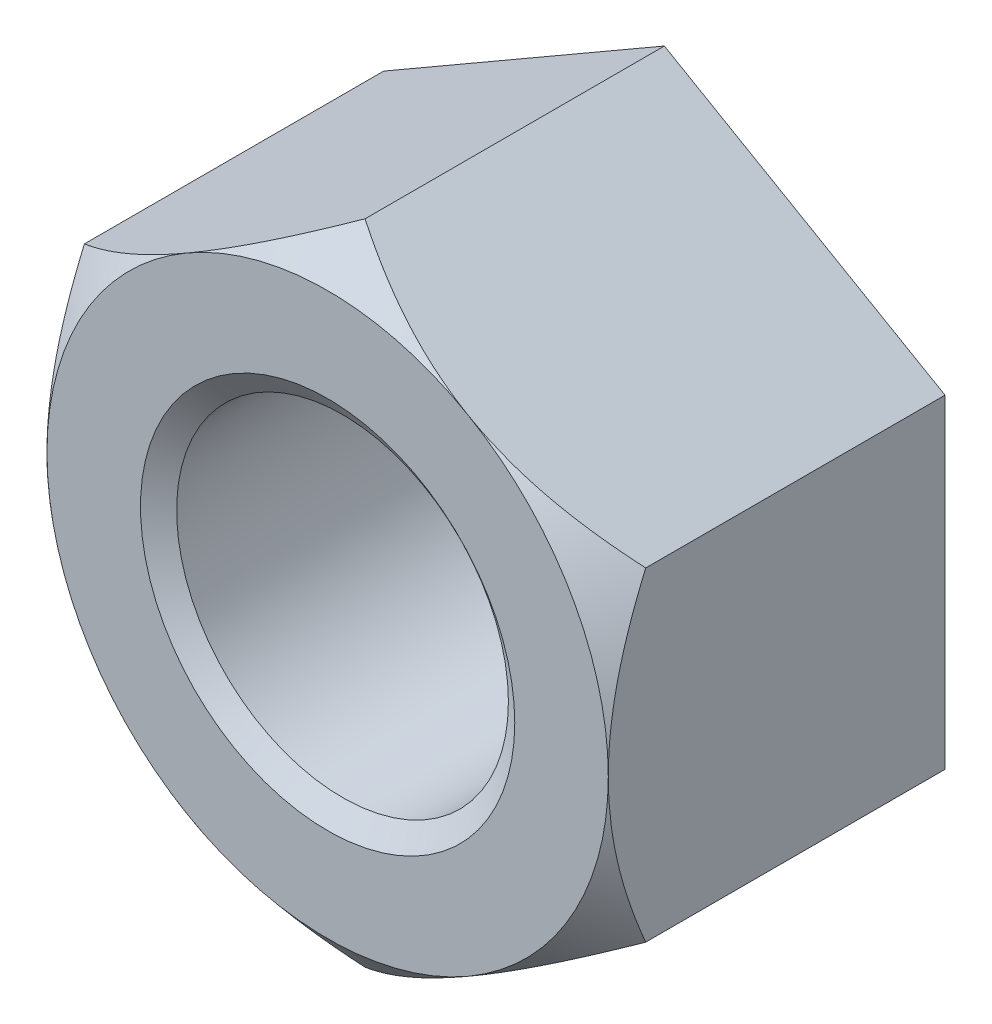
ISO-10303-21;
HEADER;
FILE_DESCRIPTION(('STEP AP214'),'2;1');
FILE_NAME('part.step','',(''),(''),'','','');
FILE_SCHEMA(('AUTOMOTIVE_DESIGN { 1 0 10303 214 1 1 1 1 }'));
ENDSEC;
DATA;
#1=APPLICATION_CONTEXT('core data for automotive mechanical design processes');
#2=APPLICATION_PROTOCOL_DEFINITION('international standard','automotive_design',2000,#1);
#3=PRODUCT_CONTEXT('',#1,'mechanical');
#4=PRODUCT('Part','Part','',(#3));
#5=PRODUCT_RELATED_PRODUCT_CATEGORY('part','',(#4));
#6=PRODUCT_DEFINITION_FORMATION('','',#4);
#7=PRODUCT_DEFINITION_CONTEXT('part definition',#1,'design');
#8=PRODUCT_DEFINITION('design','',#6,#7);
#9=PRODUCT_DEFINITION_SHAPE('','',#8);
#10=(LENGTH_UNIT() NAMED_UNIT(*) SI_UNIT(.MILLI.,.METRE.));
#11=(NAMED_UNIT(*) PLANE_ANGLE_UNIT() SI_UNIT($,.RADIAN.));
#12=(NAMED_UNIT(*) SI_UNIT($,.STERADIAN.) SOLID_ANGLE_UNIT());
#13=UNCERTAINTY_MEASURE_WITH_UNIT(LENGTH_MEASURE(1.E-05),#10,'distance_accuracy_value','');
#14=(GEOMETRIC_REPRESENTATION_CONTEXT(3) GLOBAL_UNCERTAINTY_ASSIGNED_CONTEXT((#13)) GLOBAL_UNIT_ASSIGNED_CONTEXT((#10,
#11,#12)) REPRESENTATION_CONTEXT('',''));
#15=CARTESIAN_POINT('',(0.,0.,0.));
#16=DIRECTION('',(0.,0.,1.));
#17=DIRECTION('',(1.,0.,0.));
#18=AXIS2_PLACEMENT_3D('',#15,#16,#17);
#19=CARTESIAN_POINT('',(0.,0.,-31.4198));
#20=DIRECTION('',(0.,0.,1.));
#21=DIRECTION('',(1.,0.,0.));
#22=AXIS2_PLACEMENT_3D('',#19,#20,#21);
#23=CYLINDRICAL_SURFACE('',#22,15.47876);
#24=CARTESIAN_POINT('',(0.,0.,-1.38902970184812));
#25=DIRECTION('',(0.,0.,1.));
#26=DIRECTION('',(1.,0.,0.));
#27=AXIS2_PLACEMENT_3D('',#24,#25,#26);
#28=CIRCLE('',#27,15.47876);
#29=CARTESIAN_POINT('',(15.47876,0.,-1.38902970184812));
#30=VERTEX_POINT('',#29);
#31=EDGE_CURVE('E131',#30,#30,#28,.F.);
#32=ORIENTED_EDGE('',*,*,#31,.F.);
#33=EDGE_LOOP('',(#32));
#34=FACE_BOUND('',#33,.T.);
#35=CARTESIAN_POINT('',(0.,0.,-30.0053702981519));
#36=DIRECTION('',(0.,0.,-1.));
#37=DIRECTION('',(-1.,0.,0.));
#38=AXIS2_PLACEMENT_3D('',#35,#36,#37);
#39=CIRCLE('',#38,15.47876);
#40=CARTESIAN_POINT('',(-15.47876,0.,-30.0053702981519));
#41=VERTEX_POINT('',#40);
#42=EDGE_CURVE('E38',#41,#41,#39,.F.);
#43=ORIENTED_EDGE('',*,*,#42,.F.);
#44=EDGE_LOOP('',(#43));
#45=FACE_BOUND('',#44,.T.);
#46=ADVANCED_FACE('F33',(#34,#45),#23,.F.);
#47=CARTESIAN_POINT('',(-52.3747999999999,0.,0.));
#48=DIRECTION('',(0.,0.,1.));
#49=DIRECTION('',(1.,0.,0.));
#50=AXIS2_PLACEMENT_3D('',#47,#48,#49);
#51=PLANE('',#50);
#52=CARTESIAN_POINT('',(0.,0.,0.));
#53=DIRECTION('',(0.,0.,1.));
#54=DIRECTION('',(1.,0.,0.));
#55=AXIS2_PLACEMENT_3D('',#52,#53,#54);
#56=CIRCLE('',#55,17.4625);
#57=CARTESIAN_POINT('',(17.4625,0.,0.));
#58=VERTEX_POINT('',#57);
#59=EDGE_CURVE('E224',#58,#58,#56,.T.);
#60=ORIENTED_EDGE('',*,*,#59,.F.);
#61=EDGE_LOOP('',(#60));
#62=FACE_BOUND('',#61,.T.);
#63=CARTESIAN_POINT('',(0.,0.,0.));
#64=DIRECTION('',(0.,0.,1.));
#65=DIRECTION('',(1.,0.,0.));
#66=AXIS2_PLACEMENT_3D('',#63,#64,#65);
#67=CIRCLE('',#66,26.1874);
#68=CARTESIAN_POINT('',(26.1874,0.,0.));
#69=VERTEX_POINT('',#68);
#70=CARTESIAN_POINT('',(13.0937,-22.6789536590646,0.));
#71=VERTEX_POINT('',#70);
#72=EDGE_CURVE('E11',#69,#71,#67,.F.);
#73=ORIENTED_EDGE('',*,*,#72,.F.);
#74=CARTESIAN_POINT('',(0.,0.,0.));
#75=DIRECTION('',(0.,0.,1.));
#76=DIRECTION('',(1.,0.,0.));
#77=AXIS2_PLACEMENT_3D('',#74,#75,#76);
#78=CIRCLE('',#77,26.1874);
#79=CARTESIAN_POINT('',(13.0937,22.6789536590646,0.));
#80=VERTEX_POINT('',#79);
#81=EDGE_CURVE('E123',#69,#80,#78,.T.);
#82=ORIENTED_EDGE('',*,*,#81,.T.);
#83=CARTESIAN_POINT('',(-13.0937,22.6789536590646,0.));
#84=VERTEX_POINT('',#83);
#85=EDGE_CURVE('E45',#84,#80,#67,.F.);
#86=ORIENTED_EDGE('',*,*,#85,.F.);
#87=CARTESIAN_POINT('',(-26.1874,0.,0.));
#88=VERTEX_POINT('',#87);
#89=EDGE_CURVE('E278',#88,#84,#67,.F.);
#90=ORIENTED_EDGE('',*,*,#89,.F.);
#91=CARTESIAN_POINT('',(-13.0937,-22.6789536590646,0.));
#92=VERTEX_POINT('',#91);
#93=EDGE_CURVE('E280',#92,#88,#67,.F.);
#94=ORIENTED_EDGE('',*,*,#93,.F.);
#95=EDGE_CURVE('E43',#71,#92,#67,.F.);
#96=ORIENTED_EDGE('',*,*,#95,.F.);
#97=EDGE_LOOP('',(#73,#82,#86,#90,#94,#96));
#98=FACE_BOUND('',#97,.T.);
#99=ADVANCED_FACE('F133',(#62,#98),#51,.T.);
#100=CARTESIAN_POINT('',(0.,30.2386048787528,-31.4198));
#101=DIRECTION('',(-0.500000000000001,0.866025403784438,0.));
#102=DIRECTION('',(-0.866025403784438,-0.500000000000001,0.));
#103=AXIS2_PLACEMENT_3D('',#100,#101,#102);
#104=PLANE('',#103);
#105=CARTESIAN_POINT('',(0.000199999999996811,30.2387203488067,-3.4925995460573));
#106=CARTESIAN_POINT('',(-0.513173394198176,29.9423240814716,-3.23712054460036));
#107=CARTESIAN_POINT('',(-1.030160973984,29.6438411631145,-2.99102600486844));
#108=CARTESIAN_POINT('',(-2.07185619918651,29.0424181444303,-2.52064199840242));
#109=CARTESIAN_POINT('',(-2.59656819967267,28.7394755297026,-2.2963654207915));
#110=CARTESIAN_POINT('',(-3.65628439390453,28.1276480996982,-1.87188633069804));
#111=CARTESIAN_POINT('',(-4.19132731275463,27.8187409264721,-1.67181180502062));
#112=CARTESIAN_POINT('',(-5.26885590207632,27.1966295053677,-1.3006798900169));
#113=CARTESIAN_POINT('',(-5.81134031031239,26.8834259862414,-1.12961764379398));
#114=CARTESIAN_POINT('',(-6.89352018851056,26.2586291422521,-0.822885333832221));
#115=CARTESIAN_POINT('',(-7.43309184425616,25.9471073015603,-0.686636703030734));
#116=CARTESIAN_POINT('',(-8.51801013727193,25.3207294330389,-0.448890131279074));
#117=CARTESIAN_POINT('',(-9.06335694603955,25.0058733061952,-0.347393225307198));
#118=CARTESIAN_POINT('',(-10.1571309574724,24.3743825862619,-0.182123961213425));
#119=CARTESIAN_POINT('',(-10.7055487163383,24.0577534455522,-0.118268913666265));
#120=CARTESIAN_POINT('',(-11.8047484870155,23.4231301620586,-0.0298594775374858));
#121=CARTESIAN_POINT('',(-12.3555303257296,23.1051361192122,-0.00530225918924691));
#122=CARTESIAN_POINT('',(-13.3804093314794,22.5134219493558,0.0031300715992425));
#123=CARTESIAN_POINT('',(-13.8544797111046,22.2397172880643,-0.00779494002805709));
#124=CARTESIAN_POINT('',(-14.8014126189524,21.6930053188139,-0.0590211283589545));
#125=CARTESIAN_POINT('',(-15.2742751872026,21.419997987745,-0.0993213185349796));
#126=CARTESIAN_POINT('',(-16.2178635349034,20.8752170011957,-0.20842230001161));
#127=CARTESIAN_POINT('',(-16.6885874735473,20.6034444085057,-0.277244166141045));
#128=CARTESIAN_POINT('',(-17.6264602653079,20.061963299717,-0.441912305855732));
#129=CARTESIAN_POINT('',(-18.0936090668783,19.7922548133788,-0.537758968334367));
#130=CARTESIAN_POINT('',(-19.0235590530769,19.2553479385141,-0.754617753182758));
#131=CARTESIAN_POINT('',(-19.4863595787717,18.9881499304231,-0.875633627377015));
#132=CARTESIAN_POINT('',(-20.4070035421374,18.4566158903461,-1.14072210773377));
#133=CARTESIAN_POINT('',(-20.8648462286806,18.1922802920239,-1.28479815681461));
#134=CARTESIAN_POINT('',(-22.2299280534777,17.4041499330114,-1.74815961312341));
#135=CARTESIAN_POINT('',(-23.1293122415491,16.8848902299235,-2.09872149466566));
#136=CARTESIAN_POINT('',(-24.3833445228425,16.1608743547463,-2.64044063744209));
#137=CARTESIAN_POINT('',(-24.7472444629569,15.9507766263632,-2.80407568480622));
#138=CARTESIAN_POINT('',(-25.4705171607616,15.5331949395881,-3.14115557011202));
#139=CARTESIAN_POINT('',(-25.8298992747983,15.3257055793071,-3.31457361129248));
#140=CARTESIAN_POINT('',(-26.1876,15.1191869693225,-3.49259954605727));
#141=B_SPLINE_CURVE_WITH_KNOTS('',3,(#105,#106,#107,#108,#109,#110,#111,#112,#113,#114,#115,
#116,#117,#118,#119,#120,#121,#122,#123,#124,#125,#126,#127,#128,#129,#130,#131,#132,#133,#134,
#135,#136,#137,#138,#139,#140),.UNSPECIFIED.,.F.,.F.,(4,2,2,2,2,2,2,2,2,2,2,2,2,2,2,2,2,4),(0.,
1.9366001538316,3.87433750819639,5.82191141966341,7.76915896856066,9.68156029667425,
11.5940185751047,13.5022598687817,15.410363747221,17.0521398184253,18.6938607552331,
20.3367969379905,21.9797567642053,23.6229616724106,25.26641214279,28.5512264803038,
29.9039535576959,31.2531400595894),.UNSPECIFIED.);
#142=CARTESIAN_POINT('',(0.,30.2386048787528,-3.4925));
#143=VERTEX_POINT('',#142);
#144=EDGE_CURVE('E187',#143,#84,#141,.T.);
#145=ORIENTED_EDGE('',*,*,#144,.F.);
#146=DIRECTION('',(0.,0.,1.));
#147=VECTOR('',#146,1.);
#148=CARTESIAN_POINT('',(0.,30.2386048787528,-31.4198));
#149=LINE('',#148,#147);
#150=CARTESIAN_POINT('',(0.,30.2386048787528,-31.4198));
#151=VERTEX_POINT('',#150);
#152=EDGE_CURVE('E248',#151,#143,#149,.T.);
#153=ORIENTED_EDGE('',*,*,#152,.F.);
#154=DIRECTION('',(-0.866025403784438,-0.500000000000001,0.));
#155=VECTOR('',#154,1.);
#156=CARTESIAN_POINT('',(0.,30.2386048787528,-31.4198));
#157=LINE('',#156,#155);
#158=CARTESIAN_POINT('',(-26.1874,15.1193024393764,-31.4198));
#159=VERTEX_POINT('',#158);
#160=EDGE_CURVE('E139',#151,#159,#157,.T.);
#161=ORIENTED_EDGE('',*,*,#160,.T.);
#162=DIRECTION('',(0.,0.,1.));
#163=VECTOR('',#162,1.);
#164=CARTESIAN_POINT('',(-26.1874,15.1193024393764,-31.4198));
#165=LINE('',#164,#163);
#166=CARTESIAN_POINT('',(-26.1874,15.1193024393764,-3.4925));
#167=VERTEX_POINT('',#166);
#168=EDGE_CURVE('E235',#159,#167,#165,.T.);
#169=ORIENTED_EDGE('',*,*,#168,.T.);
#170=EDGE_CURVE('E181',#84,#167,#141,.T.);
#171=ORIENTED_EDGE('',*,*,#170,.F.);
#172=EDGE_LOOP('',(#145,#153,#161,#169,#171));
#173=FACE_BOUND('',#172,.T.);
#174=ADVANCED_FACE('F35',(#173),#104,.T.);
#175=CARTESIAN_POINT('',(26.1874,15.1193024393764,-31.4198));
#176=DIRECTION('',(0.500000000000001,0.866025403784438,0.));
#177=DIRECTION('',(-0.866025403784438,0.500000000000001,0.));
#178=AXIS2_PLACEMENT_3D('',#175,#176,#177);
#179=PLANE('',#178);
#180=CARTESIAN_POINT('',(26.1876,15.1191869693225,-3.49259954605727));
#181=CARTESIAN_POINT('',(25.6742266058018,15.4155832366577,-3.23712054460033));
#182=CARTESIAN_POINT('',(25.157239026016,15.7140661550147,-2.99102600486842));
#183=CARTESIAN_POINT('',(24.1155438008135,16.3154891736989,-2.5206419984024));
#184=CARTESIAN_POINT('',(23.5908318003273,16.6184317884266,-2.29636542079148));
#185=CARTESIAN_POINT('',(22.5311156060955,17.230259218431,-1.87188633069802));
#186=CARTESIAN_POINT('',(21.9960726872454,17.5391663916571,-1.6718118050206));
#187=CARTESIAN_POINT('',(20.9185440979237,18.1612778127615,-1.30067989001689));
#188=CARTESIAN_POINT('',(20.3760596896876,18.4744813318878,-1.12961764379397));
#189=CARTESIAN_POINT('',(19.2938798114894,19.0992781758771,-0.822885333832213));
#190=CARTESIAN_POINT('',(18.7543081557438,19.4108000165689,-0.686636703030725));
#191=CARTESIAN_POINT('',(17.6693898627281,20.0371778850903,-0.448890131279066));
#192=CARTESIAN_POINT('',(17.1240430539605,20.352034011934,-0.347393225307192));
#193=CARTESIAN_POINT('',(16.0302690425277,20.9835247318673,-0.182123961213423));
#194=CARTESIAN_POINT('',(15.4818512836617,21.300153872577,-0.118268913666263));
#195=CARTESIAN_POINT('',(14.3826515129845,21.9347771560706,-0.0298594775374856));
#196=CARTESIAN_POINT('',(13.8318696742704,22.2527711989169,-0.00530225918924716));
#197=CARTESIAN_POINT('',(12.8069906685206,22.8444853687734,0.00313007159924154));
#198=CARTESIAN_POINT('',(12.3329202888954,23.1181900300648,-0.00779494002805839));
#199=CARTESIAN_POINT('',(11.3859873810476,23.6649019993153,-0.0590211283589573));
#200=CARTESIAN_POINT('',(10.9131248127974,23.9379093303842,-0.0993213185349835));
#201=CARTESIAN_POINT('',(9.96953646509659,24.4826903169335,-0.208422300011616));
#202=CARTESIAN_POINT('',(9.49881252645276,24.7544629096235,-0.277244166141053));
#203=CARTESIAN_POINT('',(8.56093973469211,25.2959440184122,-0.441912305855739));
#204=CARTESIAN_POINT('',(8.09379093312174,25.5656525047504,-0.537758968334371));
#205=CARTESIAN_POINT('',(7.16384094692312,26.1025593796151,-0.754617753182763));
#206=CARTESIAN_POINT('',(6.7010404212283,26.3697573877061,-0.875633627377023));
#207=CARTESIAN_POINT('',(5.78039645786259,26.9012914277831,-1.14072210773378));
#208=CARTESIAN_POINT('',(5.32255377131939,27.1656270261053,-1.28479815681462));
#209=CARTESIAN_POINT('',(3.95747194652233,27.9537573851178,-1.74815961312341));
#210=CARTESIAN_POINT('',(3.05808775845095,28.4730170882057,-2.09872149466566));
#211=CARTESIAN_POINT('',(1.80405547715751,29.1970329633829,-2.6404406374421));
#212=CARTESIAN_POINT('',(1.44015553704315,29.407130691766,-2.80407568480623));
#213=CARTESIAN_POINT('',(0.716882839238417,29.8247123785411,-3.14115557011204));
#214=CARTESIAN_POINT('',(0.3575007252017,30.0322017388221,-3.3145736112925));
#215=CARTESIAN_POINT('',(-0.000200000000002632,30.2387203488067,-3.4925995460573));
#216=B_SPLINE_CURVE_WITH_KNOTS('',3,(#180,#181,#182,#183,#184,#185,#186,#187,#188,#189,#190,
#191,#192,#193,#194,#195,#196,#197,#198,#199,#200,#201,#202,#203,#204,#205,#206,#207,#208,#209,
#210,#211,#212,#213,#214,#215),.UNSPECIFIED.,.F.,.F.,(4,2,2,2,2,2,2,2,2,2,2,2,2,2,2,2,2,4),(0.,
1.9366001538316,3.87433750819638,5.82191141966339,7.76915896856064,9.68156029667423,
11.5940185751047,13.5022598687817,15.4103637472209,17.0521398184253,18.6938607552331,
20.3367969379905,21.9797567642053,23.6229616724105,25.26641214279,28.5512264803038,
29.9039535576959,31.2531400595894),.UNSPECIFIED.);
#217=CARTESIAN_POINT('',(26.1874,15.1193024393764,-3.4925));
#218=VERTEX_POINT('',#217);
#219=EDGE_CURVE('E126',#218,#80,#216,.T.);
#220=ORIENTED_EDGE('',*,*,#219,.F.);
#221=DIRECTION('',(0.,0.,1.));
#222=VECTOR('',#221,1.);
#223=CARTESIAN_POINT('',(26.1874,15.1193024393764,-31.4198));
#224=LINE('',#223,#222);
#225=CARTESIAN_POINT('',(26.1874,15.1193024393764,-31.4198));
#226=VERTEX_POINT('',#225);
#227=EDGE_CURVE('E138',#226,#218,#224,.T.);
#228=ORIENTED_EDGE('',*,*,#227,.F.);
#229=DIRECTION('',(-0.866025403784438,0.500000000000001,0.));
#230=VECTOR('',#229,1.);
#231=CARTESIAN_POINT('',(26.1874,15.1193024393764,-31.4198));
#232=LINE('',#231,#230);
#233=EDGE_CURVE('E239',#226,#151,#232,.T.);
#234=ORIENTED_EDGE('',*,*,#233,.T.);
#235=ORIENTED_EDGE('',*,*,#152,.T.);
#236=EDGE_CURVE('E150',#80,#143,#216,.T.);
#237=ORIENTED_EDGE('',*,*,#236,.F.);
#238=EDGE_LOOP('',(#220,#228,#234,#235,#237));
#239=FACE_BOUND('',#238,.T.);
#240=ADVANCED_FACE('F166',(#239),#179,.T.);
#241=CARTESIAN_POINT('',(26.1874,15.1193024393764,-31.4198));
#242=DIRECTION('',(-1.,0.,0.));
#243=DIRECTION('',(0.,0.,1.));
#244=AXIS2_PLACEMENT_3D('',#241,#242,#243);
#245=PLANE('',#244);
#246=ORIENTED_EDGE('',*,*,#227,.T.);
#247=CARTESIAN_POINT('',(26.1874,-33.4640354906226,-14.0565423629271));
#248=CARTESIAN_POINT('',(26.1874,-33.0407746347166,-13.7691881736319));
#249=CARTESIAN_POINT('',(26.1874,-32.6165571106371,-13.4832440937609));
#250=CARTESIAN_POINT('',(26.1874,-31.7660401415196,-12.914455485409));
#251=CARTESIAN_POINT('',(26.1874,-31.339740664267,-12.6316110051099));
#252=CARTESIAN_POINT('',(26.1874,-30.0573097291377,-11.788043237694));
#253=CARTESIAN_POINT('',(26.1874,-29.1978203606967,-11.2324044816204));
#254=CARTESIAN_POINT('',(26.1874,-27.4622936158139,-10.1336577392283));
#255=CARTESIAN_POINT('',(26.1874,-26.5861821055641,-9.59066658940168));
#256=CARTESIAN_POINT('',(26.1874,-24.8216648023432,-8.52510234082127));
#257=CARTESIAN_POINT('',(26.1874,-23.9332597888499,-8.00252795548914));
#258=CARTESIAN_POINT('',(26.1874,-22.0934376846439,-6.95488948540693));
#259=CARTESIAN_POINT('',(26.1874,-21.1412173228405,-6.43122911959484));
#260=CARTESIAN_POINT('',(26.1874,-19.2179109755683,-5.41917114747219));
#261=CARTESIAN_POINT('',(26.1874,-18.2468222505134,-4.93077871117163));
#262=CARTESIAN_POINT('',(26.1874,-16.2858249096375,-4.00024738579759));
#263=CARTESIAN_POINT('',(26.1874,-15.2959747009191,-3.5579862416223));
#264=CARTESIAN_POINT('',(26.1874,-13.2927456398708,-2.73059024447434));
#265=CARTESIAN_POINT('',(26.1874,-12.2793767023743,-2.34543180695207));
#266=CARTESIAN_POINT('',(26.1874,-10.7553803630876,-1.82671246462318));
#267=CARTESIAN_POINT('',(26.1874,-10.2540776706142,-1.6655893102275));
#268=CARTESIAN_POINT('',(26.1874,-9.24575138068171,-1.36228852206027));
#269=CARTESIAN_POINT('',(26.1874,-8.73872795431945,-1.22011032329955));
#270=CARTESIAN_POINT('',(26.1874,-7.71922567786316,-0.95663251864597));
#271=CARTESIAN_POINT('',(26.1874,-7.20674644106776,-0.835334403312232));
#272=CARTESIAN_POINT('',(26.1874,-6.1769285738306,-0.615535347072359));
#273=CARTESIAN_POINT('',(26.1874,-5.65959024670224,-0.517032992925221));
#274=CARTESIAN_POINT('',(26.1874,-4.63047547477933,-0.346152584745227));
#275=CARTESIAN_POINT('',(26.1874,-4.11877434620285,-0.273323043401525));
#276=CARTESIAN_POINT('',(26.1874,-3.09242158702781,-0.15263877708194));
#277=CARTESIAN_POINT('',(26.1874,-2.57776997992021,-0.104783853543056));
#278=CARTESIAN_POINT('',(26.1874,-1.54674640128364,-0.0350055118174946));
#279=CARTESIAN_POINT('',(26.1874,-1.03037458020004,-0.0130798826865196));
#280=CARTESIAN_POINT('',(26.1874,0.00281373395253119,0.00439081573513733));
#281=CARTESIAN_POINT('',(26.1874,0.519630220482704,-6.37334660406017E-05));
#282=CARTESIAN_POINT('',(26.1874,1.51784720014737,-0.0340789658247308));
#283=CARTESIAN_POINT('',(26.1874,1.99930668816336,-0.0619421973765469));
#284=CARTESIAN_POINT('',(26.1874,2.96039298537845,-0.140052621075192));
#285=CARTESIAN_POINT('',(26.1874,3.44001982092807,-0.190299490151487));
#286=CARTESIAN_POINT('',(26.1874,4.39653344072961,-0.312320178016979));
#287=CARTESIAN_POINT('',(26.1874,4.87342010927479,-0.384094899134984));
#288=CARTESIAN_POINT('',(26.1874,5.82366675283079,-0.548023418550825));
#289=CARTESIAN_POINT('',(26.1874,6.29702668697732,-0.640177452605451));
#290=CARTESIAN_POINT('',(26.1874,7.24941488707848,-0.845630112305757));
#291=CARTESIAN_POINT('',(26.1874,7.72835665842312,-0.959328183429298));
#292=CARTESIAN_POINT('',(26.1874,8.68151250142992,-1.20500429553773));
#293=CARTESIAN_POINT('',(26.1874,9.15572653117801,-1.33698249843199));
#294=CARTESIAN_POINT('',(26.1874,10.0990528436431,-1.61759280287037));
#295=CARTESIAN_POINT('',(26.1874,10.5681664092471,-1.76622060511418));
#296=CARTESIAN_POINT('',(26.1874,11.501293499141,-2.07859293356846));
#297=CARTESIAN_POINT('',(26.1874,11.9653071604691,-2.24233705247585));
#298=CARTESIAN_POINT('',(26.1874,13.2708643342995,-2.72484850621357));
#299=CARTESIAN_POINT('',(26.1874,14.1065210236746,-3.05960737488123));
#300=CARTESIAN_POINT('',(26.1874,15.7619371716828,-3.76657752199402));
#301=CARTESIAN_POINT('',(26.1874,16.5816920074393,-4.13879950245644));
#302=CARTESIAN_POINT('',(26.1874,18.2074356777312,-4.91425190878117));
#303=CARTESIAN_POINT('',(26.1874,19.013408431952,-5.31751588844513));
#304=CARTESIAN_POINT('',(26.1874,20.6121672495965,-6.14910126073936));
#305=CARTESIAN_POINT('',(26.1874,21.4049544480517,-6.57742048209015));
#306=CARTESIAN_POINT('',(26.1874,22.9837347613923,-7.45735306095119));
#307=CARTESIAN_POINT('',(26.1874,23.7696579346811,-7.90909147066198));
#308=CARTESIAN_POINT('',(26.1874,25.3312973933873,-8.82986014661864));
#309=CARTESIAN_POINT('',(26.1874,26.1070134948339,-9.2988907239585));
#310=CARTESIAN_POINT('',(26.1874,27.6491010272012,-10.2510900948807));
#311=CARTESIAN_POINT('',(26.1874,28.4154774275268,-10.7342508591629));
#312=CARTESIAN_POINT('',(26.1874,29.9404580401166,-11.7126502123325));
#313=CARTESIAN_POINT('',(26.1874,30.6990623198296,-12.2078886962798));
#314=CARTESIAN_POINT('',(26.1874,32.1349530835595,-13.1592105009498));
#315=CARTESIAN_POINT('',(26.1874,32.8128762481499,-13.6143345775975));
#316=CARTESIAN_POINT('',(26.1874,34.1638401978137,-14.5317809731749));
#317=CARTESIAN_POINT('',(26.1874,34.8368809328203,-14.9941033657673));
#318=CARTESIAN_POINT('',(26.1874,36.178700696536,-15.9250689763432));
#319=CARTESIAN_POINT('',(26.1874,36.8474791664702,-16.393712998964));
#320=CARTESIAN_POINT('',(26.1874,38.18116093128,-17.3364840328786));
#321=CARTESIAN_POINT('',(26.1874,38.8460642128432,-17.8106110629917));
#322=CARTESIAN_POINT('',(26.1874,40.1636369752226,-18.7573870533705));
#323=CARTESIAN_POINT('',(26.1874,40.8163519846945,-19.2299726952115));
#324=CARTESIAN_POINT('',(26.1874,42.1187514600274,-20.1793024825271));
#325=CARTESIAN_POINT('',(26.1874,42.7684359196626,-20.656046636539));
#326=CARTESIAN_POINT('',(26.1874,44.0649065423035,-21.6131035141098));
#327=CARTESIAN_POINT('',(26.1874,44.7116934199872,-22.0934152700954));
#328=CARTESIAN_POINT('',(26.1874,46.0027915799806,-23.057341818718));
#329=CARTESIAN_POINT('',(26.1874,46.6471028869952,-23.5409565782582));
#330=CARTESIAN_POINT('',(26.1874,47.2903085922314,-24.0260331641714));
#331=B_SPLINE_CURVE_WITH_KNOTS('',3,(#247,#248,#249,#250,#251,#252,#253,#254,#255,#256,#257,
#258,#259,#260,#261,#262,#263,#264,#265,#266,#267,#268,#269,#270,#271,#272,#273,#274,#275,#276,
#277,#278,#279,#280,#281,#282,#283,#284,#285,#286,#287,#288,#289,#290,#291,#292,#293,#294,#295,
#296,#297,#298,#299,#300,#301,#302,#303,#304,#305,#306,#307,#308,#309,#310,#311,#312,#313,#314,
#315,#316,#317,#318,#319,#320,#321,#322,#323,#324,#325,#326,#327,#328,#329,#330),.UNSPECIFIED.,
.F.,.F.,(4,2,2,2,2,2,2,2,2,2,2,2,2,2,2,2,2,2,2,2,2,2,2,2,2,2,2,2,2,2,2,2,2,2,2,2,2,2,2,2,2,4),
(0.,1.53475844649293,3.06954071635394,6.13973882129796,9.23171402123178,12.3234940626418,
15.5830497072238,18.8430822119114,22.0942430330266,25.3440572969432,26.92343182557,
28.5027592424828,30.0821993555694,31.6615415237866,33.2115323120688,34.7615107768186,
36.311357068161,37.8611809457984,39.3074473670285,40.7536929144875,42.1999990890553,
43.6463219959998,45.1226872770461,46.5990656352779,48.0750636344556,49.5510218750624,
52.2504359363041,54.9506233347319,57.6537715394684,60.3566858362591,63.0759229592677,
65.7952090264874,68.5129788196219,71.2307250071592,73.6802575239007,76.1298151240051,
78.5796875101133,81.0295683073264,83.4470625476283,85.864561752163,88.2814276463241,
90.6982693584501),.UNSPECIFIED.);
#332=EDGE_CURVE('E118',#218,#69,#331,.F.);
#333=ORIENTED_EDGE('',*,*,#332,.T.);
#334=CARTESIAN_POINT('',(26.1874,-15.1193024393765,-3.4925));
#335=VERTEX_POINT('',#334);
#336=EDGE_CURVE('E107',#69,#335,#331,.F.);
#337=ORIENTED_EDGE('',*,*,#336,.T.);
#338=DIRECTION('',(0.,0.,1.));
#339=VECTOR('',#338,1.);
#340=CARTESIAN_POINT('',(26.1874,-15.1193024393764,-31.4198));
#341=LINE('',#340,#339);
#342=CARTESIAN_POINT('',(26.1874,-15.1193024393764,-31.4198));
#343=VERTEX_POINT('',#342);
#344=EDGE_CURVE('E245',#343,#335,#341,.T.);
#345=ORIENTED_EDGE('',*,*,#344,.F.);
#346=DIRECTION('',(0.,-1.,0.));
#347=VECTOR('',#346,1.);
#348=CARTESIAN_POINT('',(26.1874,15.1193024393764,-31.4198));
#349=LINE('',#348,#347);
#350=EDGE_CURVE('E253',#226,#343,#349,.T.);
#351=ORIENTED_EDGE('',*,*,#350,.F.);
#352=EDGE_LOOP('',(#246,#333,#337,#345,#351));
#353=FACE_BOUND('',#352,.T.);
#354=ADVANCED_FACE('F136',(#353),#245,.F.);
#355=CARTESIAN_POINT('',(0.,-30.2386048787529,-31.4198));
#356=DIRECTION('',(0.500000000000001,-0.866025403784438,0.));
#357=DIRECTION('',(0.866025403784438,0.500000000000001,0.));
#358=AXIS2_PLACEMENT_3D('',#355,#356,#357);
#359=PLANE('',#358);
#360=CARTESIAN_POINT('',(-0.000199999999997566,-30.2387203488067,-3.49259954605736));
#361=CARTESIAN_POINT('',(0.513173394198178,-29.9423240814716,-3.23712054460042));
#362=CARTESIAN_POINT('',(1.030160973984,-29.6438411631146,-2.9910260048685));
#363=CARTESIAN_POINT('',(2.07185619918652,-29.0424181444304,-2.52064199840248));
#364=CARTESIAN_POINT('',(2.59656819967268,-28.7394755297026,-2.29636542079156));
#365=CARTESIAN_POINT('',(3.65628439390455,-28.1276480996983,-1.87188633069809));
#366=CARTESIAN_POINT('',(4.19132731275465,-27.8187409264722,-1.67181180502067));
#367=CARTESIAN_POINT('',(5.26885590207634,-27.1966295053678,-1.30067989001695));
#368=CARTESIAN_POINT('',(5.81134031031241,-26.8834259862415,-1.12961764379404));
#369=CARTESIAN_POINT('',(6.89352018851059,-26.2586291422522,-0.822885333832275));
#370=CARTESIAN_POINT('',(7.43309184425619,-25.9471073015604,-0.686636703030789));
#371=CARTESIAN_POINT('',(8.51801013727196,-25.320729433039,-0.448890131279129));
#372=CARTESIAN_POINT('',(9.06335694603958,-25.0058733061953,-0.347393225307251));
#373=CARTESIAN_POINT('',(10.1571309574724,-24.3743825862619,-0.182123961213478));
#374=CARTESIAN_POINT('',(10.7055487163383,-24.0577534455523,-0.118268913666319));
#375=CARTESIAN_POINT('',(11.8047484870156,-23.4231301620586,-0.0298594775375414));
#376=CARTESIAN_POINT('',(12.3555303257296,-23.1051361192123,-0.00530225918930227));
#377=CARTESIAN_POINT('',(13.3804093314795,-22.5134219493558,0.00313007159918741));
#378=CARTESIAN_POINT('',(13.8544797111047,-22.2397172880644,-0.007794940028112));
#379=CARTESIAN_POINT('',(14.8014126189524,-21.693005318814,-0.0590211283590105));
#380=CARTESIAN_POINT('',(15.2742751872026,-21.419997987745,-0.0993213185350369));
#381=CARTESIAN_POINT('',(16.2178635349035,-20.8752170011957,-0.20842230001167));
#382=CARTESIAN_POINT('',(16.6885874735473,-20.6034444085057,-0.277244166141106));
#383=CARTESIAN_POINT('',(17.626460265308,-20.0619632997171,-0.441912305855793));
#384=CARTESIAN_POINT('',(18.0936090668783,-19.7922548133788,-0.537758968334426));
#385=CARTESIAN_POINT('',(19.023559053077,-19.2553479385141,-0.754617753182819));
#386=CARTESIAN_POINT('',(19.4863595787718,-18.9881499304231,-0.875633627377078));
#387=CARTESIAN_POINT('',(20.4070035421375,-18.4566158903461,-1.14072210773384));
#388=CARTESIAN_POINT('',(20.8648462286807,-18.1922802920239,-1.28479815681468));
#389=CARTESIAN_POINT('',(22.2299280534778,-17.4041499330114,-1.74815961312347));
#390=CARTESIAN_POINT('',(23.1293122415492,-16.8848902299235,-2.09872149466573));
#391=CARTESIAN_POINT('',(24.3833445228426,-16.1608743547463,-2.64044063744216));
#392=CARTESIAN_POINT('',(24.7472444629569,-15.9507766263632,-2.80407568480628));
#393=CARTESIAN_POINT('',(25.4705171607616,-15.5331949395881,-3.14115557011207));
#394=CARTESIAN_POINT('',(25.8298992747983,-15.3257055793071,-3.31457361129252));
#395=CARTESIAN_POINT('',(26.1876,-15.1191869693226,-3.4925995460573));
#396=B_SPLINE_CURVE_WITH_KNOTS('',3,(#360,#361,#362,#363,#364,#365,#366,#367,#368,#369,#370,
#371,#372,#373,#374,#375,#376,#377,#378,#379,#380,#381,#382,#383,#384,#385,#386,#387,#388,#389,
#390,#391,#392,#393,#394,#395),.UNSPECIFIED.,.F.,.F.,(4,2,2,2,2,2,2,2,2,2,2,2,2,2,2,2,2,4),(0.,
1.93660015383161,3.87433750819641,5.82191141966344,7.76915896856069,9.68156029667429,
11.5940185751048,13.5022598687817,15.410363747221,17.0521398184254,18.6938607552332,
20.3367969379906,21.9797567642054,23.6229616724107,25.2664121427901,28.5512264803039,
29.903953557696,31.2531400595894),.UNSPECIFIED.);
#397=CARTESIAN_POINT('',(-1.17961196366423E-13,-30.2386048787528,-3.4925));
#398=VERTEX_POINT('',#397);
#399=EDGE_CURVE('E52',#398,#71,#396,.T.);
#400=ORIENTED_EDGE('',*,*,#399,.F.);
#401=DIRECTION('',(0.,0.,1.));
#402=VECTOR('',#401,1.);
#403=CARTESIAN_POINT('',(0.,-30.2386048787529,-31.4198));
#404=LINE('',#403,#402);
#405=CARTESIAN_POINT('',(0.,-30.2386048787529,-31.4198));
#406=VERTEX_POINT('',#405);
#407=EDGE_CURVE('E242',#406,#398,#404,.T.);
#408=ORIENTED_EDGE('',*,*,#407,.F.);
#409=DIRECTION('',(0.866025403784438,0.500000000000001,0.));
#410=VECTOR('',#409,1.);
#411=CARTESIAN_POINT('',(0.,-30.2386048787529,-31.4198));
#412=LINE('',#411,#410);
#413=EDGE_CURVE('E255',#406,#343,#412,.T.);
#414=ORIENTED_EDGE('',*,*,#413,.T.);
#415=ORIENTED_EDGE('',*,*,#344,.T.);
#416=EDGE_CURVE('E113',#71,#335,#396,.T.);
#417=ORIENTED_EDGE('',*,*,#416,.F.);
#418=EDGE_LOOP('',(#400,#408,#414,#415,#417));
#419=FACE_BOUND('',#418,.T.);
#420=ADVANCED_FACE('F165',(#419),#359,.T.);
#421=CARTESIAN_POINT('',(-26.1874,-15.1193024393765,-31.4198));
#422=DIRECTION('',(-0.500000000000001,-0.866025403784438,0.));
#423=DIRECTION('',(0.866025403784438,-0.500000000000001,0.));
#424=AXIS2_PLACEMENT_3D('',#421,#422,#423);
#425=PLANE('',#424);
#426=CARTESIAN_POINT('',(-26.1876,-15.1191869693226,-3.4925995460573));
#427=CARTESIAN_POINT('',(-25.6742266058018,-15.4155832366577,-3.23712054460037));
#428=CARTESIAN_POINT('',(-25.157239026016,-15.7140661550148,-2.99102600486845));
#429=CARTESIAN_POINT('',(-24.1155438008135,-16.315489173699,-2.52064199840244));
#430=CARTESIAN_POINT('',(-23.5908318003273,-16.6184317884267,-2.29636542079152));
#431=CARTESIAN_POINT('',(-22.5311156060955,-17.2302592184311,-1.87188633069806));
#432=CARTESIAN_POINT('',(-21.9960726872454,-17.5391663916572,-1.67181180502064));
#433=CARTESIAN_POINT('',(-20.9185440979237,-18.1612778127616,-1.30067989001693));
#434=CARTESIAN_POINT('',(-20.3760596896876,-18.4744813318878,-1.12961764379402));
#435=CARTESIAN_POINT('',(-19.2938798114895,-19.0992781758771,-0.822885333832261));
#436=CARTESIAN_POINT('',(-18.7543081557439,-19.4108000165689,-0.686636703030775));
#437=CARTESIAN_POINT('',(-17.6693898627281,-20.0371778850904,-0.448890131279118));
#438=CARTESIAN_POINT('',(-17.1240430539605,-20.352034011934,-0.347393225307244));
#439=CARTESIAN_POINT('',(-16.0302690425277,-20.9835247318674,-0.182123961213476));
#440=CARTESIAN_POINT('',(-15.4818512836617,-21.300153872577,-0.118268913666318));
#441=CARTESIAN_POINT('',(-14.3826515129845,-21.9347771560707,-0.0298594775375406));
#442=CARTESIAN_POINT('',(-13.8318696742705,-22.252771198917,-0.00530225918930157));
#443=CARTESIAN_POINT('',(-12.8069906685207,-22.8444853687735,0.00313007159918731));
#444=CARTESIAN_POINT('',(-12.3329202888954,-23.1181900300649,-0.00779494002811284));
#445=CARTESIAN_POINT('',(-11.3859873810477,-23.6649019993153,-0.0590211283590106));
#446=CARTESIAN_POINT('',(-10.9131248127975,-23.9379093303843,-0.0993213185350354));
#447=CARTESIAN_POINT('',(-9.96953646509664,-24.4826903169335,-0.208422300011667));
#448=CARTESIAN_POINT('',(-9.49881252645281,-24.7544629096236,-0.277244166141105));
#449=CARTESIAN_POINT('',(-8.56093973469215,-25.2959440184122,-0.441912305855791));
#450=CARTESIAN_POINT('',(-8.09379093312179,-25.5656525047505,-0.537758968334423));
#451=CARTESIAN_POINT('',(-7.16384094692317,-26.1025593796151,-0.754617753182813));
#452=CARTESIAN_POINT('',(-6.70104042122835,-26.3697573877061,-0.87563362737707));
#453=CARTESIAN_POINT('',(-5.78039645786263,-26.9012914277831,-1.14072210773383));
#454=CARTESIAN_POINT('',(-5.32255377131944,-27.1656270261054,-1.28479815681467));
#455=CARTESIAN_POINT('',(-3.95747194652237,-27.9537573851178,-1.74815961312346));
#456=CARTESIAN_POINT('',(-3.05808775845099,-28.4730170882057,-2.0987214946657));
#457=CARTESIAN_POINT('',(-1.80405547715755,-29.197032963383,-2.64044063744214));
#458=CARTESIAN_POINT('',(-1.44015553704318,-29.4071306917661,-2.80407568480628));
#459=CARTESIAN_POINT('',(-0.716882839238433,-29.8247123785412,-3.14115557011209));
#460=CARTESIAN_POINT('',(-0.357500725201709,-30.0322017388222,-3.31457361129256));
#461=CARTESIAN_POINT('',(0.000200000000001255,-30.2387203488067,-3.49259954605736));
#462=B_SPLINE_CURVE_WITH_KNOTS('',3,(#426,#427,#428,#429,#430,#431,#432,#433,#434,#435,#436,
#437,#438,#439,#440,#441,#442,#443,#444,#445,#446,#447,#448,#449,#450,#451,#452,#453,#454,#455,
#456,#457,#458,#459,#460,#461),.UNSPECIFIED.,.F.,.F.,(4,2,2,2,2,2,2,2,2,2,2,2,2,2,2,2,2,4),(0.,
1.93660015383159,3.87433750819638,5.82191141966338,7.76915896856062,9.6815602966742,
11.5940185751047,13.5022598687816,15.4103637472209,17.0521398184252,18.693860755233,
20.3367969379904,21.9797567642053,23.6229616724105,25.2664121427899,28.5512264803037,
29.9039535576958,31.2531400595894),.UNSPECIFIED.);
#463=CARTESIAN_POINT('',(-26.1874,-15.1193024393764,-3.4925));
#464=VERTEX_POINT('',#463);
#465=EDGE_CURVE('E59',#464,#92,#462,.T.);
#466=ORIENTED_EDGE('',*,*,#465,.F.);
#467=DIRECTION('',(0.,0.,1.));
#468=VECTOR('',#467,1.);
#469=CARTESIAN_POINT('',(-26.1874,-15.1193024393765,-31.4198));
#470=LINE('',#469,#468);
#471=CARTESIAN_POINT('',(-26.1874,-15.1193024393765,-31.4198));
#472=VERTEX_POINT('',#471);
#473=EDGE_CURVE('E238',#472,#464,#470,.T.);
#474=ORIENTED_EDGE('',*,*,#473,.F.);
#475=DIRECTION('',(0.866025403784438,-0.500000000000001,0.));
#476=VECTOR('',#475,1.);
#477=CARTESIAN_POINT('',(-26.1874,-15.1193024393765,-31.4198));
#478=LINE('',#477,#476);
#479=EDGE_CURVE('E258',#472,#406,#478,.T.);
#480=ORIENTED_EDGE('',*,*,#479,.T.);
#481=ORIENTED_EDGE('',*,*,#407,.T.);
#482=EDGE_CURVE('E180',#92,#398,#462,.T.);
#483=ORIENTED_EDGE('',*,*,#482,.F.);
#484=EDGE_LOOP('',(#466,#474,#480,#481,#483));
#485=FACE_BOUND('',#484,.T.);
#486=ADVANCED_FACE('F172',(#485),#425,.T.);
#487=CARTESIAN_POINT('',(-26.1874,15.1193024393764,-31.4198));
#488=DIRECTION('',(-1.,0.,0.));
#489=DIRECTION('',(0.,0.,1.));
#490=AXIS2_PLACEMENT_3D('',#487,#488,#489);
#491=PLANE('',#490);
#492=CARTESIAN_POINT('',(-26.1874,-33.4640354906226,-14.0565423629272));
#493=CARTESIAN_POINT('',(-26.1874,-33.0407746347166,-13.7691881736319));
#494=CARTESIAN_POINT('',(-26.1874,-32.6165571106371,-13.483244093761));
#495=CARTESIAN_POINT('',(-26.1874,-31.7660401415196,-12.914455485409));
#496=CARTESIAN_POINT('',(-26.1874,-31.3397406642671,-12.6316110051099));
#497=CARTESIAN_POINT('',(-26.1874,-30.0573097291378,-11.788043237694));
#498=CARTESIAN_POINT('',(-26.1874,-29.1978203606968,-11.2324044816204));
#499=CARTESIAN_POINT('',(-26.1874,-27.4622936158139,-10.1336577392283));
#500=CARTESIAN_POINT('',(-26.1874,-26.5861821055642,-9.5906665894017));
#501=CARTESIAN_POINT('',(-26.1874,-24.8216648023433,-8.52510234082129));
#502=CARTESIAN_POINT('',(-26.1874,-23.9332597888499,-8.00252795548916));
#503=CARTESIAN_POINT('',(-26.1874,-22.0934376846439,-6.95488948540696));
#504=CARTESIAN_POINT('',(-26.1874,-21.1412173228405,-6.43122911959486));
#505=CARTESIAN_POINT('',(-26.1874,-19.2179109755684,-5.41917114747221));
#506=CARTESIAN_POINT('',(-26.1874,-18.2468222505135,-4.93077871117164));
#507=CARTESIAN_POINT('',(-26.1874,-16.2858249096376,-4.0002473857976));
#508=CARTESIAN_POINT('',(-26.1874,-15.2959747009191,-3.55798624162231));
#509=CARTESIAN_POINT('',(-26.1874,-13.2927456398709,-2.73059024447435));
#510=CARTESIAN_POINT('',(-26.1874,-12.2793767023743,-2.34543180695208));
#511=CARTESIAN_POINT('',(-26.1874,-10.7553803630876,-1.82671246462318));
#512=CARTESIAN_POINT('',(-26.1874,-10.2540776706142,-1.6655893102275));
#513=CARTESIAN_POINT('',(-26.1874,-9.24575138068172,-1.36228852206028));
#514=CARTESIAN_POINT('',(-26.1874,-8.73872795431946,-1.22011032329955));
#515=CARTESIAN_POINT('',(-26.1874,-7.71922567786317,-0.956632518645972));
#516=CARTESIAN_POINT('',(-26.1874,-7.20674644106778,-0.835334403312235));
#517=CARTESIAN_POINT('',(-26.1874,-6.17692857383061,-0.615535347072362));
#518=CARTESIAN_POINT('',(-26.1874,-5.65959024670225,-0.517032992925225));
#519=CARTESIAN_POINT('',(-26.1874,-4.63047547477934,-0.346152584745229));
#520=CARTESIAN_POINT('',(-26.1874,-4.11877434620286,-0.273323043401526));
#521=CARTESIAN_POINT('',(-26.1874,-3.09242158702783,-0.15263877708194));
#522=CARTESIAN_POINT('',(-26.1874,-2.57776997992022,-0.104783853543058));
#523=CARTESIAN_POINT('',(-26.1874,-1.54674640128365,-0.0350055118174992));
#524=CARTESIAN_POINT('',(-26.1874,-1.03037458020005,-0.0130798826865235));
#525=CARTESIAN_POINT('',(-26.1874,0.00281373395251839,0.00439081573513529));
#526=CARTESIAN_POINT('',(-26.1874,0.519630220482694,-6.37334660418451E-05));
#527=CARTESIAN_POINT('',(-26.1874,1.51784720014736,-0.0340789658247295));
#528=CARTESIAN_POINT('',(-26.1874,1.99930668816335,-0.0619421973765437));
#529=CARTESIAN_POINT('',(-26.1874,2.96039298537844,-0.140052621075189));
#530=CARTESIAN_POINT('',(-26.1874,3.44001982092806,-0.190299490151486));
#531=CARTESIAN_POINT('',(-26.1874,4.3965334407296,-0.31232017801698));
#532=CARTESIAN_POINT('',(-26.1874,4.87342010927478,-0.384094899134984));
#533=CARTESIAN_POINT('',(-26.1874,5.82366675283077,-0.548023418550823));
#534=CARTESIAN_POINT('',(-26.1874,6.29702668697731,-0.640177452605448));
#535=CARTESIAN_POINT('',(-26.1874,7.24941488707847,-0.845630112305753));
#536=CARTESIAN_POINT('',(-26.1874,7.72835665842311,-0.959328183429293));
#537=CARTESIAN_POINT('',(-26.1874,8.68151250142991,-1.20500429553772));
#538=CARTESIAN_POINT('',(-26.1874,9.155726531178,-1.33698249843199));
#539=CARTESIAN_POINT('',(-26.1874,10.0990528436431,-1.61759280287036));
#540=CARTESIAN_POINT('',(-26.1874,10.5681664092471,-1.76622060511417));
#541=CARTESIAN_POINT('',(-26.1874,11.501293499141,-2.07859293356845));
#542=CARTESIAN_POINT('',(-26.1874,11.965307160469,-2.24233705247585));
#543=CARTESIAN_POINT('',(-26.1874,13.2708643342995,-2.72484850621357));
#544=CARTESIAN_POINT('',(-26.1874,14.1065210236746,-3.05960737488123));
#545=CARTESIAN_POINT('',(-26.1874,15.7619371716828,-3.76657752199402));
#546=CARTESIAN_POINT('',(-26.1874,16.5816920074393,-4.13879950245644));
#547=CARTESIAN_POINT('',(-26.1874,18.2074356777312,-4.91425190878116));
#548=CARTESIAN_POINT('',(-26.1874,19.013408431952,-5.31751588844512));
#549=CARTESIAN_POINT('',(-26.1874,20.6121672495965,-6.14910126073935));
#550=CARTESIAN_POINT('',(-26.1874,21.4049544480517,-6.57742048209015));
#551=CARTESIAN_POINT('',(-26.1874,22.9837347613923,-7.45735306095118));
#552=CARTESIAN_POINT('',(-26.1874,23.7696579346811,-7.90909147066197));
#553=CARTESIAN_POINT('',(-26.1874,25.3312973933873,-8.82986014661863));
#554=CARTESIAN_POINT('',(-26.1874,26.1070134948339,-9.29889072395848));
#555=CARTESIAN_POINT('',(-26.1874,27.6491010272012,-10.2510900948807));
#556=CARTESIAN_POINT('',(-26.1874,28.4154774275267,-10.7342508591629));
#557=CARTESIAN_POINT('',(-26.1874,29.9404580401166,-11.7126502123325));
#558=CARTESIAN_POINT('',(-26.1874,30.6990623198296,-12.2078886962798));
#559=CARTESIAN_POINT('',(-26.1874,32.1349530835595,-13.1592105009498));
#560=CARTESIAN_POINT('',(-26.1874,32.8128762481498,-13.6143345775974));
#561=CARTESIAN_POINT('',(-26.1874,34.1638401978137,-14.5317809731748));
#562=CARTESIAN_POINT('',(-26.1874,34.8368809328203,-14.9941033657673));
#563=CARTESIAN_POINT('',(-26.1874,36.178700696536,-15.9250689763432));
#564=CARTESIAN_POINT('',(-26.1874,36.8474791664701,-16.3937129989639));
#565=CARTESIAN_POINT('',(-26.1874,38.1811609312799,-17.3364840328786));
#566=CARTESIAN_POINT('',(-26.1874,38.8460642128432,-17.8106110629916));
#567=CARTESIAN_POINT('',(-26.1874,40.1636369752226,-18.7573870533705));
#568=CARTESIAN_POINT('',(-26.1874,40.8163519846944,-19.2299726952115));
#569=CARTESIAN_POINT('',(-26.1874,42.1187514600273,-20.179302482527));
#570=CARTESIAN_POINT('',(-26.1874,42.7684359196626,-20.656046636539));
#571=CARTESIAN_POINT('',(-26.1874,44.0649065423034,-21.6131035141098));
#572=CARTESIAN_POINT('',(-26.1874,44.7116934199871,-22.0934152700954));
#573=CARTESIAN_POINT('',(-26.1874,46.0027915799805,-23.0573418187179));
#574=CARTESIAN_POINT('',(-26.1874,46.6471028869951,-23.5409565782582));
#575=CARTESIAN_POINT('',(-26.1874,47.2903085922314,-24.0260331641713));
#576=B_SPLINE_CURVE_WITH_KNOTS('',3,(#492,#493,#494,#495,#496,#497,#498,#499,#500,#501,#502,
#503,#504,#505,#506,#507,#508,#509,#510,#511,#512,#513,#514,#515,#516,#517,#518,#519,#520,#521,
#522,#523,#524,#525,#526,#527,#528,#529,#530,#531,#532,#533,#534,#535,#536,#537,#538,#539,#540,
#541,#542,#543,#544,#545,#546,#547,#548,#549,#550,#551,#552,#553,#554,#555,#556,#557,#558,#559,
#560,#561,#562,#563,#564,#565,#566,#567,#568,#569,#570,#571,#572,#573,#574,#575),.UNSPECIFIED.,
.F.,.F.,(4,2,2,2,2,2,2,2,2,2,2,2,2,2,2,2,2,2,2,2,2,2,2,2,2,2,2,2,2,2,2,2,2,2,2,2,2,2,2,2,2,4),
(0.,1.53475844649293,3.06954071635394,6.13973882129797,9.23171402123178,12.3234940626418,
15.5830497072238,18.8430822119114,22.0942430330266,25.3440572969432,26.9234318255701,
28.5027592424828,30.0821993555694,31.6615415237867,33.2115323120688,34.7615107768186,
36.311357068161,37.8611809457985,39.3074473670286,40.7536929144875,42.1999990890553,
43.6463219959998,45.1226872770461,46.5990656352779,48.0750636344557,49.5510218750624,
52.2504359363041,54.9506233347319,57.6537715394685,60.3566858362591,63.0759229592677,
65.7952090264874,68.5129788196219,71.2307250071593,73.6802575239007,76.1298151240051,
78.5796875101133,81.0295683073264,83.4470625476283,85.864561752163,88.2814276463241,
90.69826935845),.UNSPECIFIED.);
#577=EDGE_CURVE('E193',#167,#88,#576,.F.);
#578=ORIENTED_EDGE('',*,*,#577,.F.);
#579=ORIENTED_EDGE('',*,*,#168,.F.);
#580=DIRECTION('',(0.,-1.,0.));
#581=VECTOR('',#580,1.);
#582=CARTESIAN_POINT('',(-26.1874,15.1193024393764,-31.4198));
#583=LINE('',#582,#581);
#584=EDGE_CURVE('E141',#159,#472,#583,.T.);
#585=ORIENTED_EDGE('',*,*,#584,.T.);
#586=ORIENTED_EDGE('',*,*,#473,.T.);
#587=EDGE_CURVE('E130',#88,#464,#576,.F.);
#588=ORIENTED_EDGE('',*,*,#587,.F.);
#589=EDGE_LOOP('',(#578,#579,#585,#586,#588));
#590=FACE_BOUND('',#589,.T.);
#591=ADVANCED_FACE('F199',(#590),#491,.T.);
#592=CARTESIAN_POINT('',(-52.3747999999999,0.,-31.4198));
#593=DIRECTION('',(0.,0.,1.));
#594=DIRECTION('',(1.,0.,0.));
#595=AXIS2_PLACEMENT_3D('',#592,#593,#594);
#596=PLANE('',#595);
#597=CARTESIAN_POINT('',(0.,0.,-31.4198));
#598=DIRECTION('',(0.,0.,1.));
#599=DIRECTION('',(1.,0.,0.));
#600=AXIS2_PLACEMENT_3D('',#597,#598,#599);
#601=CIRCLE('',#600,17.4625);
#602=CARTESIAN_POINT('',(17.4625,0.,-31.4198));
#603=VERTEX_POINT('',#602);
#604=EDGE_CURVE('E225',#603,#603,#601,.F.);
#605=ORIENTED_EDGE('',*,*,#604,.F.);
#606=EDGE_LOOP('',(#605));
#607=FACE_BOUND('',#606,.T.);
#608=ORIENTED_EDGE('',*,*,#160,.F.);
#609=ORIENTED_EDGE('',*,*,#233,.F.);
#610=ORIENTED_EDGE('',*,*,#350,.T.);
#611=ORIENTED_EDGE('',*,*,#413,.F.);
#612=ORIENTED_EDGE('',*,*,#479,.F.);
#613=ORIENTED_EDGE('',*,*,#584,.F.);
#614=EDGE_LOOP('',(#608,#609,#610,#611,#612,#613));
#615=FACE_BOUND('',#614,.T.);
#616=ADVANCED_FACE('F202',(#607,#615),#596,.F.);
#617=CARTESIAN_POINT('',(0.,0.,-3.4925));
#618=DIRECTION('',(0.,0.,-1.));
#619=DIRECTION('',(-1.,0.,0.));
#620=AXIS2_PLACEMENT_3D('',#617,#618,#619);
#621=CONICAL_SURFACE('',#620,30.2386048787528,0.85932558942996);
#622=ORIENTED_EDGE('',*,*,#219,.T.);
#623=ORIENTED_EDGE('',*,*,#81,.F.);
#624=ORIENTED_EDGE('',*,*,#332,.F.);
#625=EDGE_LOOP('',(#622,#623,#624));
#626=FACE_BOUND('',#625,.T.);
#627=ADVANCED_FACE('F124',(#626),#621,.T.);
#628=ORIENTED_EDGE('',*,*,#236,.T.);
#629=ORIENTED_EDGE('',*,*,#144,.T.);
#630=ORIENTED_EDGE('',*,*,#85,.T.);
#631=EDGE_LOOP('',(#628,#629,#630));
#632=FACE_BOUND('',#631,.T.);
#633=ADVANCED_FACE('F275',(#632),#621,.T.);
#634=ORIENTED_EDGE('',*,*,#170,.T.);
#635=ORIENTED_EDGE('',*,*,#577,.T.);
#636=ORIENTED_EDGE('',*,*,#89,.T.);
#637=EDGE_LOOP('',(#634,#635,#636));
#638=FACE_BOUND('',#637,.T.);
#639=ADVANCED_FACE('F279',(#638),#621,.T.);
#640=ORIENTED_EDGE('',*,*,#465,.T.);
#641=ORIENTED_EDGE('',*,*,#93,.T.);
#642=ORIENTED_EDGE('',*,*,#587,.T.);
#643=EDGE_LOOP('',(#640,#641,#642));
#644=FACE_BOUND('',#643,.T.);
#645=ADVANCED_FACE('F158',(#644),#621,.T.);
#646=ORIENTED_EDGE('',*,*,#399,.T.);
#647=ORIENTED_EDGE('',*,*,#95,.T.);
#648=ORIENTED_EDGE('',*,*,#482,.T.);
#649=EDGE_LOOP('',(#646,#647,#648));
#650=FACE_BOUND('',#649,.T.);
#651=ADVANCED_FACE('F281',(#650),#621,.T.);
#652=ORIENTED_EDGE('',*,*,#72,.T.);
#653=ORIENTED_EDGE('',*,*,#416,.T.);
#654=ORIENTED_EDGE('',*,*,#336,.F.);
#655=EDGE_LOOP('',(#652,#653,#654));
#656=FACE_BOUND('',#655,.T.);
#657=ADVANCED_FACE('F109',(#656),#621,.T.);
#658=CARTESIAN_POINT('',(0.,0.,-1.52793267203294));
#659=DIRECTION('',(0.,0.,1.));
#660=DIRECTION('',(1.,0.,0.));
#661=AXIS2_PLACEMENT_3D('',#658,#659,#660);
#662=CONICAL_SURFACE('',#661,15.280386,0.959931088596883);
#663=ORIENTED_EDGE('',*,*,#59,.T.);
#664=EDGE_LOOP('',(#663));
#665=FACE_BOUND('',#664,.T.);
#666=ORIENTED_EDGE('',*,*,#31,.T.);
#667=EDGE_LOOP('',(#666));
#668=FACE_BOUND('',#667,.T.);
#669=ADVANCED_FACE('F287',(#665,#668),#662,.F.);
#670=CARTESIAN_POINT('',(0.,0.,-31.3944));
#671=DIRECTION('',(0.,0.,-1.));
#672=DIRECTION('',(-1.,0.,0.));
#673=AXIS2_PLACEMENT_3D('',#670,#671,#672);
#674=CONICAL_SURFACE('',#673,17.4625,0.95993108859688);
#675=CARTESIAN_POINT('',(0.,0.,-31.3944));
#676=DIRECTION('',(0.,0.,1.));
#677=DIRECTION('',(1.,0.,0.));
#678=AXIS2_PLACEMENT_3D('',#675,#676,#677);
#679=CIRCLE('',#678,17.4625);
#680=CARTESIAN_POINT('',(17.4625,0.,-31.3944));
#681=VERTEX_POINT('',#680);
#682=EDGE_CURVE('E228',#681,#681,#679,.T.);
#683=ORIENTED_EDGE('',*,*,#682,.F.);
#684=EDGE_LOOP('',(#683));
#685=FACE_BOUND('',#684,.T.);
#686=ORIENTED_EDGE('',*,*,#42,.T.);
#687=EDGE_LOOP('',(#686));
#688=FACE_BOUND('',#687,.T.);
#689=ADVANCED_FACE('F312',(#685,#688),#674,.F.);
#690=CARTESIAN_POINT('',(0.,0.,-25.0375057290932));
#691=DIRECTION('',(0.,0.,1.));
#692=DIRECTION('',(1.,0.,0.));
#693=AXIS2_PLACEMENT_3D('',#690,#691,#692);
#694=CYLINDRICAL_SURFACE('',#693,17.4625);
#695=ORIENTED_EDGE('',*,*,#682,.T.);
#696=EDGE_LOOP('',(#695));
#697=FACE_BOUND('',#696,.T.);
#698=ORIENTED_EDGE('',*,*,#604,.T.);
#699=EDGE_LOOP('',(#698));
#700=FACE_BOUND('',#699,.T.);
#701=ADVANCED_FACE('F322',(#697,#700),#694,.F.);
#702=CLOSED_SHELL('',(#46,#99,#174,#240,#354,#420,#486,#591,#616,#627,#633,#639,#645,#651,#657,
#669,#689,#701));
#703=MANIFOLD_SOLID_BREP('B2',#702);
#704=ADVANCED_BREP_SHAPE_REPRESENTATION('',(#18,#703),#14);
#705=SHAPE_DEFINITION_REPRESENTATION(#9,#704);
ENDSEC;
END-ISO-10303-21;
